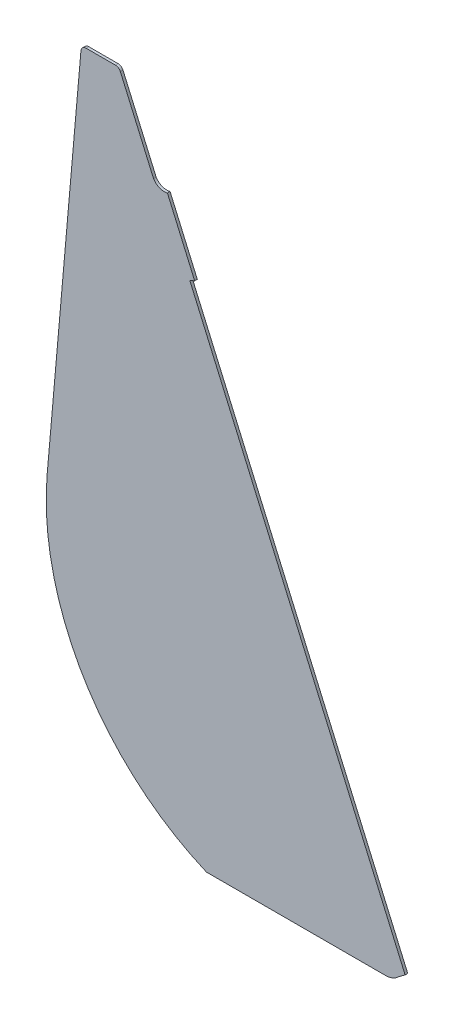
from build123d import *

# Parameters (mm, degrees)
BOSS_EXTRUDE2_DEPTH = 3.175
SKETCH6_W           = 3.175
SKETCH6_H           = 647.7
CUT_EXTRUDE1_DEPTH  = 6.35
SKETCH7_W           = 6.35
SKETCH7_H           = 3.175
CUT_EXTRUDE2_DEPTH  = 2.54


with BuildPart() as part:
    # Sketch1 → Boss-Extrude2 (new body)
    with BuildSketch(Plane.XY):
        with BuildLine():
            Line((-126.889709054, 291.041666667), (-171.416461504, 393.170833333))
            ThreePointArc((-171.416461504, 393.170833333), (-180.864395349, 393.680495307), (-188.133716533, 399.736911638))
            Line((-188.133716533, 399.736911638), (-224.260753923, 482.6))
            Line((-224.260753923, 482.6), (-228.13569606, 491.487794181))
            ThreePointArc((-228.13569606, 491.487794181), (-230.477484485, 494.262132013), (-233.956529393, 495.3))
            Line((-233.956529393, 495.3), (-269.302608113, 495.3))
            ThreePointArc((-269.302608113, 495.3), (-273.59130604, 493.632901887), (-275.628136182, 489.506951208))
            Line((-275.628136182, 489.506951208), (-316.276403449, 27.847560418))
            ThreePointArc((-316.276403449, 27.847560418), (-272.301382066, -163.273412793), (-124.434078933, -292.1))
            Line((-124.434078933, -292.1), (91.44, -292.1))
            ThreePointArc((91.44, -292.1), (100.046052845, -290.366131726), (107.30931496, -285.435060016))
            Line((107.30931496, -285.435060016), (120.261045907, -275.837776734))
            Line((120.261045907, -275.837776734), (116.277115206, -266.7))
            Line((116.277115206, -266.7), (0, 0))
            Line((0, 0), (-126.889709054, 291.041666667))
        make_face()
    extrude(amount=BOSS_EXTRUDE2_DEPTH)

    # Sketch6 → Cut-Extrude1 (cut)
    with BuildSketch(Plane(origin=(0, 0, 0), x_dir=(0, 0, -1), z_dir=(0.9166666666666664, 0.39965262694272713, 0))):
        with Locations((-1.5875, 22.936061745)):
            Rectangle(SKETCH6_W, SKETCH6_H)
    extrude(amount=-CUT_EXTRUDE1_DEPTH, mode=Mode.SUBTRACT)

    # Sketch7 → Cut-Extrude2 (cut)
    with BuildSketch(Plane(origin=(120.261045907, -275.837776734, 0), x_dir=(0.9166666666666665, 0.39965262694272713, 0), z_dir=(-0.39965262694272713, 0.9166666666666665, 0))):
        with Locations((-3.175, -1.5875)):
            Rectangle(SKETCH7_W, SKETCH7_H)
    extrude(amount=-CUT_EXTRUDE2_DEPTH, mode=Mode.SUBTRACT)


solid = part.part
